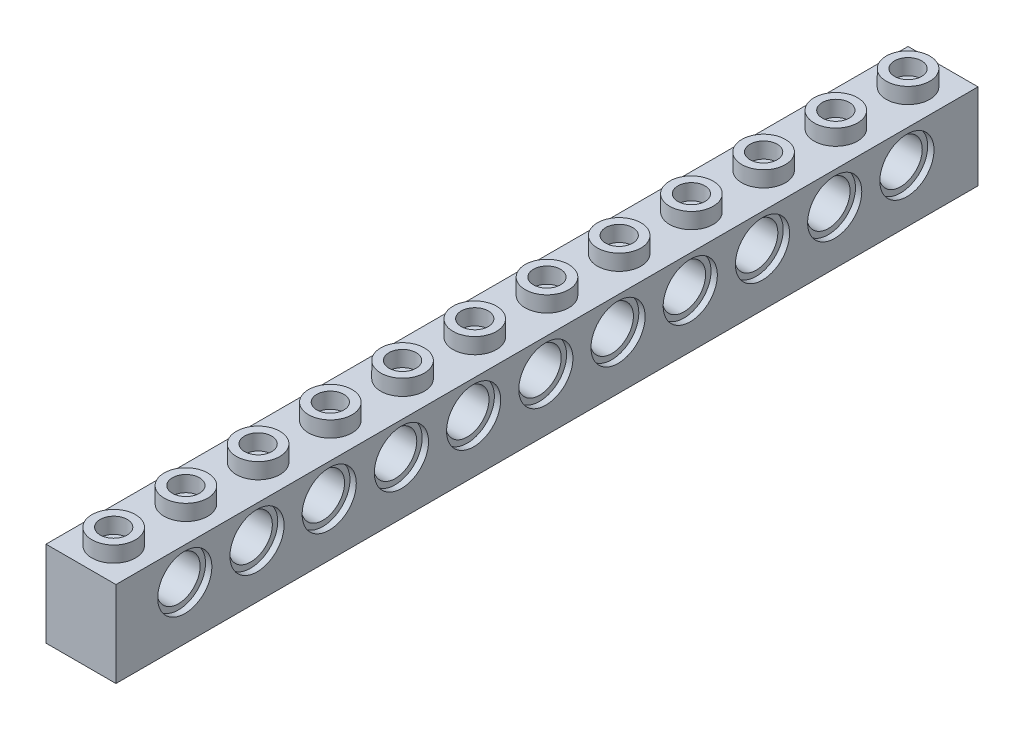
from build123d import *

# Parameters (mm, degrees)
SKETCH1_W           = 7.75
SKETCH1_H           = 9.5
BOSS_EXTRUDE1_DEPTH = 95.5
SKETCH2_R           = 2.415
SKETCH2_R_2         = 1.5
BOSS_EXTRUDE2_DEPTH = 1.75
LPATTERN1_COUNT     = 12
LPATTERN1_PITCH     = 8
SKETCH4_W           = 4.85
SKETCH4_H           = 92.6
CUT_EXTRUDE1_DEPTH  = 1.75
SKETCH5_R           = 1.5
BOSS_EXTRUDE3_DEPTH = 1.75
LPATTERN2_COUNT     = 11
LPATTERN2_PITCH     = 8
SKETCH7_R           = 3
CUT_EXTRUDE2_DEPTH  = 0.7
CUT_EXTRUDE3_START  = -0.7
SKETCH8_R           = 3
CUT_EXTRUDE3_DEPTH  = 0.7
SKETCH9_R           = 2.4
CUT_EXTRUDE4_DEPTH  = 97.034173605
LPATTERN3_COUNT     = 11
LPATTERN3_PITCH     = 8


with BuildPart() as part:
    # Sketch1 → Boss-Extrude1 (new body)
    with BuildSketch(Plane.XY):
        Rectangle(SKETCH1_W, SKETCH1_H)
    extrude(amount=BOSS_EXTRUDE1_DEPTH)

    # Sketch2 → Boss-Extrude2 (add)
    with BuildSketch(Plane(origin=(0, 4.75, 0), x_dir=(-1, 0, 0), z_dir=(0, 1, 0))):
        with Locations(Location((0, 3.875, 0), (0, 0, 180))):
            Circle(SKETCH2_R)
        with Locations((0, 3.875)):
            Circle(SKETCH2_R_2, mode=Mode.SUBTRACT)
    boss_extrude2 = extrude(amount=BOSS_EXTRUDE2_DEPTH)

    # LPattern1: Boss-Extrude2 ×12
    with Locations(*[(0, 0, i * LPATTERN1_PITCH) for i in range(1, LPATTERN1_COUNT)]):
        add(boss_extrude2)

    # Sketch4 → Cut-Extrude1 (cut)
    with BuildSketch(Plane.XZ.offset(4.75)):
        with Locations((0, 47.75)):
            Rectangle(SKETCH4_W, SKETCH4_H)
    extrude(amount=-CUT_EXTRUDE1_DEPTH, mode=Mode.SUBTRACT)

    # Sketch5 → Boss-Extrude3 (add)
    with BuildSketch(Plane.XZ.offset(3)):
        with Locations(Location((0, 87.9, 0), (0, 0, 270))):
            Circle(SKETCH5_R)
    boss_extrude3 = extrude(amount=BOSS_EXTRUDE3_DEPTH)

    # LPattern2: Boss-Extrude3 ×11
    with Locations(*[(0, 0, -i * LPATTERN2_PITCH) for i in range(1, LPATTERN2_COUNT)]):
        add(boss_extrude3)

    # Sketch7 → Cut-Extrude2 (cut)
    with BuildSketch(Plane.ZY.offset(3.875)):
        with Locations((87.875, 1.15)):
            Circle(SKETCH7_R)
    cut_extrude2 = extrude(amount=-CUT_EXTRUDE2_DEPTH, mode=Mode.SUBTRACT)

    # Sketch8 → Cut-Extrude3 (cut)
    with BuildSketch(Plane(origin=(3.875, 0, 0), x_dir=(0, 0, -1), z_dir=(1, 0, 0)).offset(CUT_EXTRUDE3_START)):
        with Locations(Location((-87.875, 1.15, 0), (0, 0, 180))):
            Circle(SKETCH8_R)
    cut_extrude3 = extrude(amount=CUT_EXTRUDE3_DEPTH, mode=Mode.SUBTRACT)

    # Sketch9 → Cut-Extrude4 (cut, through all)
    with BuildSketch(Plane(origin=(3.875, 0, 0), x_dir=(0, 0, -1), z_dir=(1, 0, 0))):
        with Locations((-87.875, 1.15)):
            Circle(SKETCH9_R)
    cut_extrude4 = extrude(amount=-CUT_EXTRUDE4_DEPTH, mode=Mode.SUBTRACT)

    # LPattern3: Cut-Extrude2, Cut-Extrude3, Cut-Extrude4 ×11
    with Locations(*[(0, 0, -i * LPATTERN3_PITCH) for i in range(1, LPATTERN3_COUNT)]):
        add(cut_extrude2, mode=Mode.SUBTRACT)
        add(cut_extrude3, mode=Mode.SUBTRACT)
        add(cut_extrude4, mode=Mode.SUBTRACT)


solid = part.part
